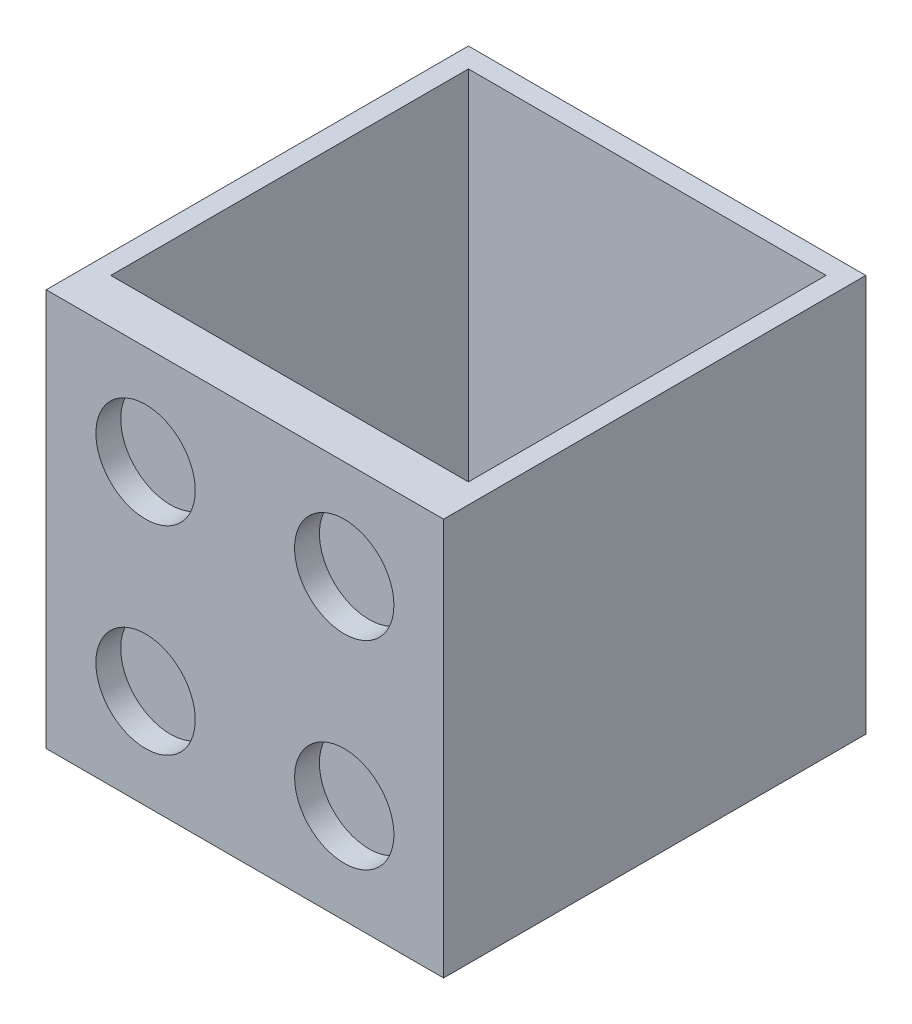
from build123d import *

# Parameters (mm, degrees)
SKETCH1_W           = 50.8
SKETCH1_H           = 50.8
BOSS_EXTRUDE1_DEPTH = 53.975
SKETCH3_R           = 6.35
SKETCH3_R_2         = 2.54
CUT_EXTRUDE2_DEPTH  = 3.175
SKETCH4_W           = 45.72
SKETCH4_H           = 45.72
CUT_EXTRUDE3_DEPTH  = 48.26


with BuildPart() as part:
    # Sketch1 → Boss-Extrude1 (new body)
    with BuildSketch(Plane.XY):
        with Locations((25.4, 25.4)):
            Rectangle(SKETCH1_W, SKETCH1_H)
    extrude(amount=BOSS_EXTRUDE1_DEPTH)

    # Sketch3 → Cut-Extrude2 (cut)
    with BuildSketch(Plane.XY.offset(53.975)):
        with Locations((12.7, 139.7)):
            Circle(SKETCH3_R)
        with Locations((38.1, 139.7)):
            Circle(SKETCH3_R)
        with Locations((63.5, 139.7)):
            Circle(SKETCH3_R_2)
        with Locations((88.9, 139.7)):
            Circle(SKETCH3_R_2)
        with Locations((88.9, 114.3)):
            Circle(SKETCH3_R_2)
        with Locations((63.5, 114.3)):
            Circle(SKETCH3_R_2)
        with Locations((38.1, 114.3)):
            Circle(SKETCH3_R)
        with Locations((12.7, 114.3)):
            Circle(SKETCH3_R)
        with Locations((88.9, 88.9)):
            Circle(SKETCH3_R_2)
        with Locations((63.5, 88.9)):
            Circle(SKETCH3_R_2)
        with Locations((38.1, 88.9)):
            Circle(SKETCH3_R)
        with Locations((12.7, 88.9)):
            Circle(SKETCH3_R)
        with Locations((88.9, 63.5)):
            Circle(SKETCH3_R_2)
        with Locations((63.5, 63.5)):
            Circle(SKETCH3_R_2)
        with Locations((38.1, 63.5)):
            Circle(SKETCH3_R)
        with Locations((12.7, 63.5)):
            Circle(SKETCH3_R)
        with Locations((88.9, 38.1)):
            Circle(SKETCH3_R_2)
        with Locations((63.5, 38.1)):
            Circle(SKETCH3_R_2)
        with Locations((38.1, 38.1)):
            Circle(SKETCH3_R)
        with Locations((12.7, 38.1)):
            Circle(SKETCH3_R)
        with Locations((88.9, 12.7)):
            Circle(SKETCH3_R_2)
        with Locations((63.5, 12.7)):
            Circle(SKETCH3_R_2)
        with Locations(Location((38.1, 12.7, 0), (0, 0, 180))):
            Circle(SKETCH3_R)
        with Locations(Location((12.7, 12.7, 0), (0, 0, 180))):
            Circle(SKETCH3_R)
    extrude(amount=-CUT_EXTRUDE2_DEPTH, mode=Mode.SUBTRACT)

    # Sketch4 → Cut-Extrude3 (cut)
    with BuildSketch(Plane(origin=(0, 50.8, 0), x_dir=(1, 0, 0), z_dir=(0, 1, 0))):
        with Locations((25.4, -25.4)):
            Rectangle(SKETCH4_W, SKETCH4_H)
    extrude(amount=-CUT_EXTRUDE3_DEPTH, mode=Mode.SUBTRACT)


solid = part.part
